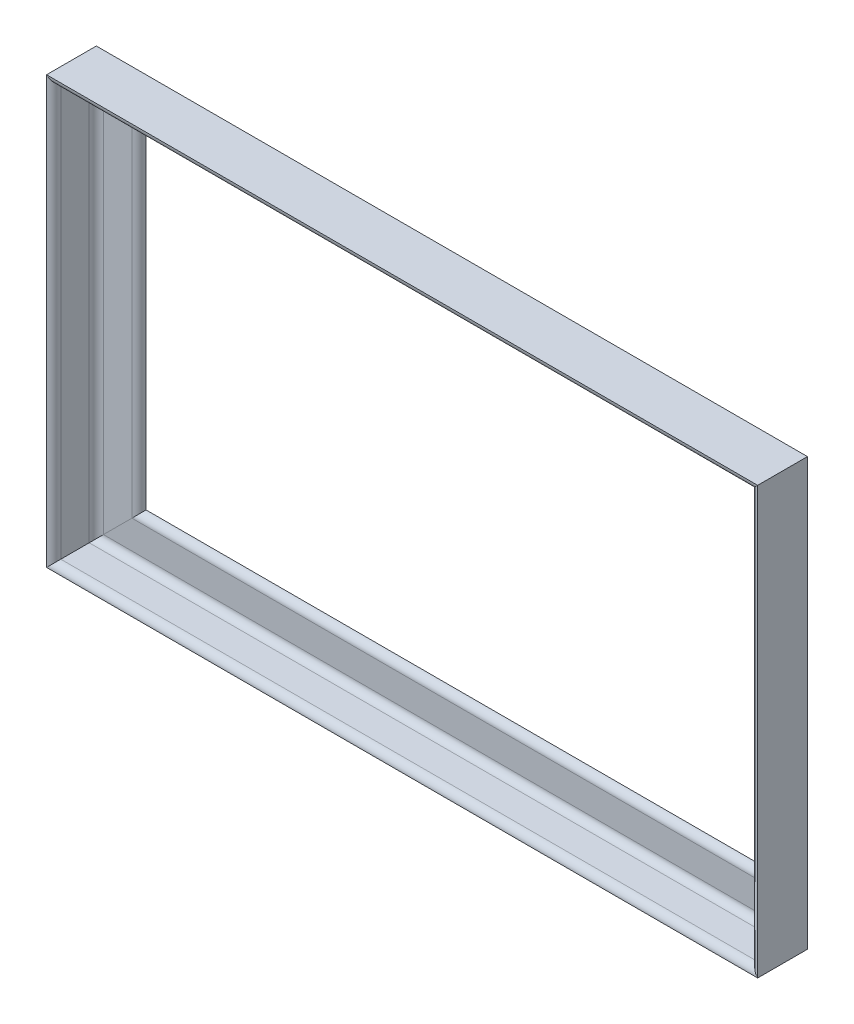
ISO-10303-21;
HEADER;
FILE_DESCRIPTION(('STEP AP214'),'2;1');
FILE_NAME('part.step','',(''),(''),'','','');
FILE_SCHEMA(('AUTOMOTIVE_DESIGN { 1 0 10303 214 1 1 1 1 }'));
ENDSEC;
DATA;
#1=APPLICATION_CONTEXT('core data for automotive mechanical design processes');
#2=APPLICATION_PROTOCOL_DEFINITION('international standard','automotive_design',2000,#1);
#3=PRODUCT_CONTEXT('',#1,'mechanical');
#4=PRODUCT('Part','Part','',(#3));
#5=PRODUCT_RELATED_PRODUCT_CATEGORY('part','',(#4));
#6=PRODUCT_DEFINITION_FORMATION('','',#4);
#7=PRODUCT_DEFINITION_CONTEXT('part definition',#1,'design');
#8=PRODUCT_DEFINITION('design','',#6,#7);
#9=PRODUCT_DEFINITION_SHAPE('','',#8);
#10=(LENGTH_UNIT() NAMED_UNIT(*) SI_UNIT(.MILLI.,.METRE.));
#11=(NAMED_UNIT(*) PLANE_ANGLE_UNIT() SI_UNIT($,.RADIAN.));
#12=(NAMED_UNIT(*) SI_UNIT($,.STERADIAN.) SOLID_ANGLE_UNIT());
#13=UNCERTAINTY_MEASURE_WITH_UNIT(LENGTH_MEASURE(1.E-05),#10,'distance_accuracy_value','');
#14=(GEOMETRIC_REPRESENTATION_CONTEXT(3) GLOBAL_UNCERTAINTY_ASSIGNED_CONTEXT((#13)) GLOBAL_UNIT_ASSIGNED_CONTEXT((#10,
#11,#12)) REPRESENTATION_CONTEXT('',''));
#15=CARTESIAN_POINT('',(0.,0.,0.));
#16=DIRECTION('',(0.,0.,1.));
#17=DIRECTION('',(1.,0.,0.));
#18=AXIS2_PLACEMENT_3D('',#15,#16,#17);
#19=CARTESIAN_POINT('',(250.,-150.,0.));
#20=DIRECTION('',(0.707106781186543,0.707106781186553,0.));
#21=DIRECTION('',(-0.707106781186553,0.707106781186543,0.));
#22=AXIS2_PLACEMENT_3D('',#19,#20,#21);
#23=PLANE('',#22);
#24=CARTESIAN_POINT('',(220.,-120.,0.));
#25=DIRECTION('',(0.707106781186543,0.707106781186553,0.));
#26=DIRECTION('',(0.707106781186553,-0.707106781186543,0.));
#27=AXIS2_PLACEMENT_3D('',#24,#25,#26);
#28=ELLIPSE('',#27,7.07106781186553,5.);
#29=CARTESIAN_POINT('',(220.,-120.,5.));
#30=VERTEX_POINT('',#29);
#31=CARTESIAN_POINT('',(215.,-115.,0.));
#32=VERTEX_POINT('',#31);
#33=EDGE_CURVE('E81',#30,#32,#28,.F.);
#34=ORIENTED_EDGE('',*,*,#33,.F.);
#35=DIRECTION('',(-0.707106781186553,0.707106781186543,0.));
#36=VECTOR('',#35,1.);
#37=CARTESIAN_POINT('',(-5.00000000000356,105.,5.00000000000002));
#38=LINE('',#37,#36);
#39=CARTESIAN_POINT('',(240.,-140.,5.));
#40=VERTEX_POINT('',#39);
#41=EDGE_CURVE('E167',#40,#30,#38,.T.);
#42=ORIENTED_EDGE('',*,*,#41,.F.);
#43=CARTESIAN_POINT('',(240.,-140.,10.));
#44=DIRECTION('',(0.707106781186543,0.707106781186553,0.));
#45=DIRECTION('',(0.707106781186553,-0.707106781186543,0.));
#46=AXIS2_PLACEMENT_3D('',#43,#44,#45);
#47=ELLIPSE('',#46,7.07106781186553,5.);
#48=CARTESIAN_POINT('',(245.,-145.,10.));
#49=VERTEX_POINT('',#48);
#50=EDGE_CURVE('E163',#49,#40,#47,.T.);
#51=ORIENTED_EDGE('',*,*,#50,.F.);
#52=DIRECTION('',(0.,0.,-1.));
#53=VECTOR('',#52,1.);
#54=CARTESIAN_POINT('',(245.,-145.,30.));
#55=LINE('',#54,#53);
#56=CARTESIAN_POINT('',(245.,-145.,30.));
#57=VERTEX_POINT('',#56);
#58=EDGE_CURVE('E159',#57,#49,#55,.T.);
#59=ORIENTED_EDGE('',*,*,#58,.F.);
#60=CARTESIAN_POINT('',(250.,-150.,30.));
#61=DIRECTION('',(0.707106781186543,0.707106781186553,0.));
#62=DIRECTION('',(0.707106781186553,-0.707106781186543,0.));
#63=AXIS2_PLACEMENT_3D('',#60,#61,#62);
#64=ELLIPSE('',#63,7.07106781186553,5.);
#65=CARTESIAN_POINT('',(250.,-150.,35.));
#66=VERTEX_POINT('',#65);
#67=EDGE_CURVE('E124',#66,#57,#64,.F.);
#68=ORIENTED_EDGE('',*,*,#67,.F.);
#69=DIRECTION('',(0.,0.,1.));
#70=VECTOR('',#69,1.);
#71=CARTESIAN_POINT('',(250.,-150.,0.));
#72=LINE('',#71,#70);
#73=CARTESIAN_POINT('',(250.,-150.,0.));
#74=VERTEX_POINT('',#73);
#75=EDGE_CURVE('E128',#74,#66,#72,.T.);
#76=ORIENTED_EDGE('',*,*,#75,.F.);
#77=DIRECTION('',(0.707106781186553,-0.707106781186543,0.));
#78=VECTOR('',#77,1.);
#79=CARTESIAN_POINT('',(-17.5000000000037,117.5,0.));
#80=LINE('',#79,#78);
#81=EDGE_CURVE('E131',#32,#74,#80,.T.);
#82=ORIENTED_EDGE('',*,*,#81,.F.);
#83=EDGE_LOOP('',(#34,#42,#51,#59,#68,#76,#82));
#84=FACE_BOUND('',#83,.T.);
#85=ADVANCED_FACE('F72',(#84),#23,.T.);
#86=CARTESIAN_POINT('',(-250.,-150.,0.));
#87=DIRECTION('',(-0.707106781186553,0.707106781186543,0.));
#88=DIRECTION('',(-0.707106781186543,-0.707106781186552,0.));
#89=AXIS2_PLACEMENT_3D('',#86,#87,#88);
#90=PLANE('',#89);
#91=DIRECTION('',(0.707106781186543,0.707106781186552,0.));
#92=VECTOR('',#91,1.);
#93=CARTESIAN_POINT('',(-232.5,-132.5,0.));
#94=LINE('',#93,#92);
#95=CARTESIAN_POINT('',(-250.,-150.,0.));
#96=VERTEX_POINT('',#95);
#97=CARTESIAN_POINT('',(-215.,-115.,0.));
#98=VERTEX_POINT('',#97);
#99=EDGE_CURVE('E137',#96,#98,#94,.T.);
#100=ORIENTED_EDGE('',*,*,#99,.F.);
#101=DIRECTION('',(0.,0.,-1.));
#102=VECTOR('',#101,1.);
#103=CARTESIAN_POINT('',(-250.,-150.,0.));
#104=LINE('',#103,#102);
#105=CARTESIAN_POINT('',(-250.,-150.,35.));
#106=VERTEX_POINT('',#105);
#107=EDGE_CURVE('E155',#106,#96,#104,.T.);
#108=ORIENTED_EDGE('',*,*,#107,.F.);
#109=CARTESIAN_POINT('',(-250.,-150.,30.));
#110=DIRECTION('',(-0.707106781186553,0.707106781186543,0.));
#111=DIRECTION('',(0.707106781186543,0.707106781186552,0.));
#112=AXIS2_PLACEMENT_3D('',#109,#110,#111);
#113=ELLIPSE('',#112,7.07106781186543,5.);
#114=CARTESIAN_POINT('',(-245.,-145.,30.));
#115=VERTEX_POINT('',#114);
#116=EDGE_CURVE('E160',#115,#106,#113,.F.);
#117=ORIENTED_EDGE('',*,*,#116,.F.);
#118=DIRECTION('',(0.,0.,1.));
#119=VECTOR('',#118,1.);
#120=CARTESIAN_POINT('',(-245.,-145.,30.));
#121=LINE('',#120,#119);
#122=CARTESIAN_POINT('',(-245.,-145.,10.));
#123=VERTEX_POINT('',#122);
#124=EDGE_CURVE('E164',#123,#115,#121,.T.);
#125=ORIENTED_EDGE('',*,*,#124,.F.);
#126=CARTESIAN_POINT('',(-240.,-140.,10.));
#127=DIRECTION('',(-0.707106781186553,0.707106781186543,0.));
#128=DIRECTION('',(0.707106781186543,0.707106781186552,0.));
#129=AXIS2_PLACEMENT_3D('',#126,#127,#128);
#130=ELLIPSE('',#129,7.07106781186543,5.);
#131=CARTESIAN_POINT('',(-240.,-140.,5.));
#132=VERTEX_POINT('',#131);
#133=EDGE_CURVE('E168',#132,#123,#130,.T.);
#134=ORIENTED_EDGE('',*,*,#133,.F.);
#135=DIRECTION('',(-0.707106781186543,-0.707106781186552,0.));
#136=VECTOR('',#135,1.);
#137=CARTESIAN_POINT('',(-245.,-145.,5.));
#138=LINE('',#137,#136);
#139=CARTESIAN_POINT('',(-220.,-120.,5.));
#140=VERTEX_POINT('',#139);
#141=EDGE_CURVE('E173',#140,#132,#138,.T.);
#142=ORIENTED_EDGE('',*,*,#141,.F.);
#143=CARTESIAN_POINT('',(-220.,-120.,0.));
#144=DIRECTION('',(-0.707106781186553,0.707106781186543,0.));
#145=DIRECTION('',(0.707106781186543,0.707106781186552,0.));
#146=AXIS2_PLACEMENT_3D('',#143,#144,#145);
#147=ELLIPSE('',#146,7.07106781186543,5.);
#148=EDGE_CURVE('E14',#98,#140,#147,.F.);
#149=ORIENTED_EDGE('',*,*,#148,.F.);
#150=EDGE_LOOP('',(#100,#108,#117,#125,#134,#142,#149));
#151=FACE_BOUND('',#150,.T.);
#152=ADVANCED_FACE('F195',(#151),#90,.T.);
#153=CARTESIAN_POINT('',(-250.,-115.,0.));
#154=DIRECTION('',(0.,0.,-1.));
#155=DIRECTION('',(-1.,0.,0.));
#156=AXIS2_PLACEMENT_3D('',#153,#154,#155);
#157=PLANE('',#156);
#158=DIRECTION('',(1.,0.,0.));
#159=VECTOR('',#158,1.);
#160=CARTESIAN_POINT('',(-250.,-115.,0.));
#161=LINE('',#160,#159);
#162=EDGE_CURVE('E138',#98,#32,#161,.T.);
#163=ORIENTED_EDGE('',*,*,#162,.T.);
#164=ORIENTED_EDGE('',*,*,#81,.T.);
#165=DIRECTION('',(1.,0.,0.));
#166=VECTOR('',#165,1.);
#167=CARTESIAN_POINT('',(-250.,-150.,0.));
#168=LINE('',#167,#166);
#169=EDGE_CURVE('E151',#96,#74,#168,.T.);
#170=ORIENTED_EDGE('',*,*,#169,.F.);
#171=ORIENTED_EDGE('',*,*,#99,.T.);
#172=EDGE_LOOP('',(#163,#164,#170,#171));
#173=FACE_BOUND('',#172,.T.);
#174=ADVANCED_FACE('F146',(#173),#157,.T.);
#175=CARTESIAN_POINT('',(-250.,-150.,0.));
#176=DIRECTION('',(0.,-1.,0.));
#177=DIRECTION('',(0.,0.,-1.));
#178=AXIS2_PLACEMENT_3D('',#175,#176,#177);
#179=PLANE('',#178);
#180=ORIENTED_EDGE('',*,*,#169,.T.);
#181=ORIENTED_EDGE('',*,*,#75,.T.);
#182=DIRECTION('',(1.,0.,0.));
#183=VECTOR('',#182,1.);
#184=CARTESIAN_POINT('',(-250.,-150.,35.));
#185=LINE('',#184,#183);
#186=EDGE_CURVE('E153',#106,#66,#185,.T.);
#187=ORIENTED_EDGE('',*,*,#186,.F.);
#188=ORIENTED_EDGE('',*,*,#107,.T.);
#189=EDGE_LOOP('',(#180,#181,#187,#188));
#190=FACE_BOUND('',#189,.T.);
#191=ADVANCED_FACE('F194',(#190),#179,.T.);
#192=CARTESIAN_POINT('',(-250.,-150.,30.));
#193=DIRECTION('',(1.,0.,0.));
#194=DIRECTION('',(0.,0.,-1.));
#195=AXIS2_PLACEMENT_3D('',#192,#193,#194);
#196=CYLINDRICAL_SURFACE('',#195,5.);
#197=ORIENTED_EDGE('',*,*,#186,.T.);
#198=ORIENTED_EDGE('',*,*,#67,.T.);
#199=DIRECTION('',(1.,0.,0.));
#200=VECTOR('',#199,1.);
#201=CARTESIAN_POINT('',(-250.,-145.,30.));
#202=LINE('',#201,#200);
#203=EDGE_CURVE('E156',#115,#57,#202,.T.);
#204=ORIENTED_EDGE('',*,*,#203,.F.);
#205=ORIENTED_EDGE('',*,*,#116,.T.);
#206=EDGE_LOOP('',(#197,#198,#204,#205));
#207=FACE_BOUND('',#206,.T.);
#208=ADVANCED_FACE('F191',(#207),#196,.T.);
#209=CARTESIAN_POINT('',(-250.,-145.,30.));
#210=DIRECTION('',(0.,1.,0.));
#211=DIRECTION('',(0.,0.,1.));
#212=AXIS2_PLACEMENT_3D('',#209,#210,#211);
#213=PLANE('',#212);
#214=ORIENTED_EDGE('',*,*,#203,.T.);
#215=ORIENTED_EDGE('',*,*,#58,.T.);
#216=DIRECTION('',(1.,0.,0.));
#217=VECTOR('',#216,1.);
#218=CARTESIAN_POINT('',(-250.,-145.,10.));
#219=LINE('',#218,#217);
#220=EDGE_CURVE('E161',#123,#49,#219,.T.);
#221=ORIENTED_EDGE('',*,*,#220,.F.);
#222=ORIENTED_EDGE('',*,*,#124,.T.);
#223=EDGE_LOOP('',(#214,#215,#221,#222));
#224=FACE_BOUND('',#223,.T.);
#225=ADVANCED_FACE('F198',(#224),#213,.T.);
#226=CARTESIAN_POINT('',(-250.,-140.,10.));
#227=DIRECTION('',(1.,0.,0.));
#228=DIRECTION('',(0.,0.,-1.));
#229=AXIS2_PLACEMENT_3D('',#226,#227,#228);
#230=CYLINDRICAL_SURFACE('',#229,5.);
#231=ORIENTED_EDGE('',*,*,#220,.T.);
#232=ORIENTED_EDGE('',*,*,#50,.T.);
#233=DIRECTION('',(1.,0.,0.));
#234=VECTOR('',#233,1.);
#235=CARTESIAN_POINT('',(-250.,-140.,4.99999999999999));
#236=LINE('',#235,#234);
#237=EDGE_CURVE('E165',#132,#40,#236,.T.);
#238=ORIENTED_EDGE('',*,*,#237,.F.);
#239=ORIENTED_EDGE('',*,*,#133,.T.);
#240=EDGE_LOOP('',(#231,#232,#238,#239));
#241=FACE_BOUND('',#240,.T.);
#242=ADVANCED_FACE('F199',(#241),#230,.F.);
#243=CARTESIAN_POINT('',(-250.,-140.,5.));
#244=DIRECTION('',(0.,0.,1.));
#245=DIRECTION('',(0.,-1.,0.));
#246=AXIS2_PLACEMENT_3D('',#243,#244,#245);
#247=PLANE('',#246);
#248=ORIENTED_EDGE('',*,*,#237,.T.);
#249=ORIENTED_EDGE('',*,*,#41,.T.);
#250=DIRECTION('',(1.,0.,0.));
#251=VECTOR('',#250,1.);
#252=CARTESIAN_POINT('',(-250.,-120.,5.));
#253=LINE('',#252,#251);
#254=EDGE_CURVE('E75',#140,#30,#253,.T.);
#255=ORIENTED_EDGE('',*,*,#254,.F.);
#256=ORIENTED_EDGE('',*,*,#141,.T.);
#257=EDGE_LOOP('',(#248,#249,#255,#256));
#258=FACE_BOUND('',#257,.T.);
#259=ADVANCED_FACE('F200',(#258),#247,.T.);
#260=CARTESIAN_POINT('',(-250.,-120.,0.));
#261=DIRECTION('',(1.,0.,0.));
#262=DIRECTION('',(0.,0.,-1.));
#263=AXIS2_PLACEMENT_3D('',#260,#261,#262);
#264=CYLINDRICAL_SURFACE('',#263,5.);
#265=ORIENTED_EDGE('',*,*,#254,.T.);
#266=ORIENTED_EDGE('',*,*,#33,.T.);
#267=ORIENTED_EDGE('',*,*,#162,.F.);
#268=ORIENTED_EDGE('',*,*,#148,.T.);
#269=EDGE_LOOP('',(#265,#266,#267,#268));
#270=FACE_BOUND('',#269,.T.);
#271=ADVANCED_FACE('F142',(#270),#264,.T.);
#272=CLOSED_SHELL('',(#85,#152,#174,#191,#208,#225,#242,#259,#271));
#273=MANIFOLD_SOLID_BREP('B2',#272);
#274=CARTESIAN_POINT('',(250.,-150.,0.));
#275=DIRECTION('',(-0.707106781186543,-0.707106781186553,0.));
#276=DIRECTION('',(0.707106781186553,-0.707106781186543,0.));
#277=AXIS2_PLACEMENT_3D('',#274,#275,#276);
#278=PLANE('',#277);
#279=CARTESIAN_POINT('',(220.,-120.,0.));
#280=DIRECTION('',(-0.707106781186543,-0.707106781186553,0.));
#281=DIRECTION('',(-0.707106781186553,0.707106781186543,0.));
#282=AXIS2_PLACEMENT_3D('',#279,#280,#281);
#283=ELLIPSE('',#282,7.07106781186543,5.);
#284=CARTESIAN_POINT('',(215.,-115.,0.));
#285=VERTEX_POINT('',#284);
#286=CARTESIAN_POINT('',(220.,-120.,5.));
#287=VERTEX_POINT('',#286);
#288=EDGE_CURVE('E376',#285,#287,#283,.F.);
#289=ORIENTED_EDGE('',*,*,#288,.F.);
#290=DIRECTION('',(-0.707106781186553,0.707106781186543,0.));
#291=VECTOR('',#290,1.);
#292=CARTESIAN_POINT('',(232.5,-132.5,0.));
#293=LINE('',#292,#291);
#294=CARTESIAN_POINT('',(250.,-150.,0.));
#295=VERTEX_POINT('',#294);
#296=EDGE_CURVE('E375',#295,#285,#293,.T.);
#297=ORIENTED_EDGE('',*,*,#296,.F.);
#298=DIRECTION('',(0.,0.,-1.));
#299=VECTOR('',#298,1.);
#300=CARTESIAN_POINT('',(250.,-150.,0.));
#301=LINE('',#300,#299);
#302=CARTESIAN_POINT('',(250.,-150.,35.));
#303=VERTEX_POINT('',#302);
#304=EDGE_CURVE('E371',#303,#295,#301,.T.);
#305=ORIENTED_EDGE('',*,*,#304,.F.);
#306=CARTESIAN_POINT('',(250.,-150.,30.));
#307=DIRECTION('',(-0.707106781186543,-0.707106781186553,0.));
#308=DIRECTION('',(-0.707106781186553,0.707106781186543,0.));
#309=AXIS2_PLACEMENT_3D('',#306,#307,#308);
#310=ELLIPSE('',#309,7.07106781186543,5.);
#311=CARTESIAN_POINT('',(245.,-145.,30.));
#312=VERTEX_POINT('',#311);
#313=EDGE_CURVE('E408',#312,#303,#310,.F.);
#314=ORIENTED_EDGE('',*,*,#313,.F.);
#315=DIRECTION('',(0.,0.,1.));
#316=VECTOR('',#315,1.);
#317=CARTESIAN_POINT('',(245.,-145.,30.));
#318=LINE('',#317,#316);
#319=CARTESIAN_POINT('',(245.,-145.,10.));
#320=VERTEX_POINT('',#319);
#321=EDGE_CURVE('E403',#320,#312,#318,.T.);
#322=ORIENTED_EDGE('',*,*,#321,.F.);
#323=CARTESIAN_POINT('',(240.,-140.,10.));
#324=DIRECTION('',(-0.707106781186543,-0.707106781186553,0.));
#325=DIRECTION('',(-0.707106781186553,0.707106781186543,0.));
#326=AXIS2_PLACEMENT_3D('',#323,#324,#325);
#327=ELLIPSE('',#326,7.07106781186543,5.);
#328=CARTESIAN_POINT('',(240.,-140.,5.));
#329=VERTEX_POINT('',#328);
#330=EDGE_CURVE('E398',#329,#320,#327,.T.);
#331=ORIENTED_EDGE('',*,*,#330,.F.);
#332=DIRECTION('',(0.707106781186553,-0.707106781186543,0.));
#333=VECTOR('',#332,1.);
#334=CARTESIAN_POINT('',(245.,-145.,5.));
#335=LINE('',#334,#333);
#336=EDGE_CURVE('E379',#287,#329,#335,.T.);
#337=ORIENTED_EDGE('',*,*,#336,.F.);
#338=EDGE_LOOP('',(#289,#297,#305,#314,#322,#331,#337));
#339=FACE_BOUND('',#338,.T.);
#340=ADVANCED_FACE('F318',(#339),#278,.T.);
#341=CARTESIAN_POINT('',(250.,150.,0.));
#342=DIRECTION('',(-0.707106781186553,0.707106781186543,0.));
#343=DIRECTION('',(-0.707106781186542,-0.707106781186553,0.));
#344=AXIS2_PLACEMENT_3D('',#341,#342,#343);
#345=PLANE('',#344);
#346=DIRECTION('',(0.707106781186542,0.707106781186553,0.));
#347=VECTOR('',#346,1.);
#348=CARTESIAN_POINT('',(82.5000000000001,-17.5000000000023,0.));
#349=LINE('',#348,#347);
#350=CARTESIAN_POINT('',(215.,115.,0.));
#351=VERTEX_POINT('',#350);
#352=CARTESIAN_POINT('',(250.,150.,0.));
#353=VERTEX_POINT('',#352);
#354=EDGE_CURVE('E387',#351,#353,#349,.T.);
#355=ORIENTED_EDGE('',*,*,#354,.F.);
#356=CARTESIAN_POINT('',(220.,120.,0.));
#357=DIRECTION('',(-0.707106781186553,0.707106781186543,0.));
#358=DIRECTION('',(0.707106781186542,0.707106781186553,0.));
#359=AXIS2_PLACEMENT_3D('',#356,#357,#358);
#360=ELLIPSE('',#359,7.07106781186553,5.);
#361=CARTESIAN_POINT('',(220.,120.,5.));
#362=VERTEX_POINT('',#361);
#363=EDGE_CURVE('E70',#362,#351,#360,.F.);
#364=ORIENTED_EDGE('',*,*,#363,.F.);
#365=DIRECTION('',(-0.707106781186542,-0.707106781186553,0.));
#366=VECTOR('',#365,1.);
#367=CARTESIAN_POINT('',(94.9999999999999,-5.00000000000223,5.00000000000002));
#368=LINE('',#367,#366);
#369=CARTESIAN_POINT('',(240.,140.,5.));
#370=VERTEX_POINT('',#369);
#371=EDGE_CURVE('E380',#370,#362,#368,.T.);
#372=ORIENTED_EDGE('',*,*,#371,.F.);
#373=CARTESIAN_POINT('',(240.,140.,10.));
#374=DIRECTION('',(-0.707106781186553,0.707106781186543,0.));
#375=DIRECTION('',(0.707106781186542,0.707106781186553,0.));
#376=AXIS2_PLACEMENT_3D('',#373,#374,#375);
#377=ELLIPSE('',#376,7.07106781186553,5.);
#378=CARTESIAN_POINT('',(245.,145.,10.));
#379=VERTEX_POINT('',#378);
#380=EDGE_CURVE('E397',#379,#370,#377,.T.);
#381=ORIENTED_EDGE('',*,*,#380,.F.);
#382=DIRECTION('',(0.,0.,-1.));
#383=VECTOR('',#382,1.);
#384=CARTESIAN_POINT('',(245.,145.,30.));
#385=LINE('',#384,#383);
#386=CARTESIAN_POINT('',(245.,145.,30.));
#387=VERTEX_POINT('',#386);
#388=EDGE_CURVE('E402',#387,#379,#385,.T.);
#389=ORIENTED_EDGE('',*,*,#388,.F.);
#390=CARTESIAN_POINT('',(250.,150.,30.));
#391=DIRECTION('',(-0.707106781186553,0.707106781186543,0.));
#392=DIRECTION('',(0.707106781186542,0.707106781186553,0.));
#393=AXIS2_PLACEMENT_3D('',#390,#391,#392);
#394=ELLIPSE('',#393,7.07106781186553,5.);
#395=CARTESIAN_POINT('',(250.,150.,35.));
#396=VERTEX_POINT('',#395);
#397=EDGE_CURVE('E407',#396,#387,#394,.F.);
#398=ORIENTED_EDGE('',*,*,#397,.F.);
#399=DIRECTION('',(0.,0.,1.));
#400=VECTOR('',#399,1.);
#401=CARTESIAN_POINT('',(250.,150.,0.));
#402=LINE('',#401,#400);
#403=EDGE_CURVE('E412',#353,#396,#402,.T.);
#404=ORIENTED_EDGE('',*,*,#403,.F.);
#405=EDGE_LOOP('',(#355,#364,#372,#381,#389,#398,#404));
#406=FACE_BOUND('',#405,.T.);
#407=ADVANCED_FACE('F432',(#406),#345,.T.);
#408=CARTESIAN_POINT('',(215.,-150.,0.));
#409=DIRECTION('',(0.,0.,-1.));
#410=DIRECTION('',(-1.,0.,0.));
#411=AXIS2_PLACEMENT_3D('',#408,#409,#410);
#412=PLANE('',#411);
#413=DIRECTION('',(0.,1.,0.));
#414=VECTOR('',#413,1.);
#415=CARTESIAN_POINT('',(250.,-150.,0.));
#416=LINE('',#415,#414);
#417=EDGE_CURVE('E391',#295,#353,#416,.T.);
#418=ORIENTED_EDGE('',*,*,#417,.F.);
#419=ORIENTED_EDGE('',*,*,#296,.T.);
#420=DIRECTION('',(0.,1.,0.));
#421=VECTOR('',#420,1.);
#422=CARTESIAN_POINT('',(215.,-150.,0.));
#423=LINE('',#422,#421);
#424=EDGE_CURVE('E382',#285,#351,#423,.T.);
#425=ORIENTED_EDGE('',*,*,#424,.T.);
#426=ORIENTED_EDGE('',*,*,#354,.T.);
#427=EDGE_LOOP('',(#418,#419,#425,#426));
#428=FACE_BOUND('',#427,.T.);
#429=ADVANCED_FACE('F390',(#428),#412,.T.);
#430=CARTESIAN_POINT('',(250.,-150.,0.));
#431=DIRECTION('',(1.,0.,0.));
#432=DIRECTION('',(0.,0.,-1.));
#433=AXIS2_PLACEMENT_3D('',#430,#431,#432);
#434=PLANE('',#433);
#435=DIRECTION('',(0.,1.,0.));
#436=VECTOR('',#435,1.);
#437=CARTESIAN_POINT('',(250.,-150.,35.));
#438=LINE('',#437,#436);
#439=EDGE_CURVE('E411',#303,#396,#438,.T.);
#440=ORIENTED_EDGE('',*,*,#439,.F.);
#441=ORIENTED_EDGE('',*,*,#304,.T.);
#442=ORIENTED_EDGE('',*,*,#417,.T.);
#443=ORIENTED_EDGE('',*,*,#403,.T.);
#444=EDGE_LOOP('',(#440,#441,#442,#443));
#445=FACE_BOUND('',#444,.T.);
#446=ADVANCED_FACE('F436',(#445),#434,.T.);
#447=CARTESIAN_POINT('',(250.,-150.,30.));
#448=DIRECTION('',(0.,1.,0.));
#449=DIRECTION('',(0.,0.,1.));
#450=AXIS2_PLACEMENT_3D('',#447,#448,#449);
#451=CYLINDRICAL_SURFACE('',#450,5.);
#452=DIRECTION('',(0.,1.,0.));
#453=VECTOR('',#452,1.);
#454=CARTESIAN_POINT('',(245.,-150.,30.));
#455=LINE('',#454,#453);
#456=EDGE_CURVE('E406',#312,#387,#455,.T.);
#457=ORIENTED_EDGE('',*,*,#456,.F.);
#458=ORIENTED_EDGE('',*,*,#313,.T.);
#459=ORIENTED_EDGE('',*,*,#439,.T.);
#460=ORIENTED_EDGE('',*,*,#397,.T.);
#461=EDGE_LOOP('',(#457,#458,#459,#460));
#462=FACE_BOUND('',#461,.T.);
#463=ADVANCED_FACE('F439',(#462),#451,.T.);
#464=CARTESIAN_POINT('',(245.,-150.,30.));
#465=DIRECTION('',(-1.,0.,0.));
#466=DIRECTION('',(0.,0.,1.));
#467=AXIS2_PLACEMENT_3D('',#464,#465,#466);
#468=PLANE('',#467);
#469=DIRECTION('',(0.,1.,0.));
#470=VECTOR('',#469,1.);
#471=CARTESIAN_POINT('',(245.,-150.,10.));
#472=LINE('',#471,#470);
#473=EDGE_CURVE('E401',#320,#379,#472,.T.);
#474=ORIENTED_EDGE('',*,*,#473,.F.);
#475=ORIENTED_EDGE('',*,*,#321,.T.);
#476=ORIENTED_EDGE('',*,*,#456,.T.);
#477=ORIENTED_EDGE('',*,*,#388,.T.);
#478=EDGE_LOOP('',(#474,#475,#476,#477));
#479=FACE_BOUND('',#478,.T.);
#480=ADVANCED_FACE('F442',(#479),#468,.T.);
#481=CARTESIAN_POINT('',(240.,-150.,10.));
#482=DIRECTION('',(0.,1.,0.));
#483=DIRECTION('',(0.,0.,1.));
#484=AXIS2_PLACEMENT_3D('',#481,#482,#483);
#485=CYLINDRICAL_SURFACE('',#484,5.);
#486=DIRECTION('',(0.,1.,0.));
#487=VECTOR('',#486,1.);
#488=CARTESIAN_POINT('',(240.,-150.,5.));
#489=LINE('',#488,#487);
#490=EDGE_CURVE('E396',#329,#370,#489,.T.);
#491=ORIENTED_EDGE('',*,*,#490,.F.);
#492=ORIENTED_EDGE('',*,*,#330,.T.);
#493=ORIENTED_EDGE('',*,*,#473,.T.);
#494=ORIENTED_EDGE('',*,*,#380,.T.);
#495=EDGE_LOOP('',(#491,#492,#493,#494));
#496=FACE_BOUND('',#495,.T.);
#497=ADVANCED_FACE('F445',(#496),#485,.F.);
#498=CARTESIAN_POINT('',(240.,-150.,5.));
#499=DIRECTION('',(0.,0.,1.));
#500=DIRECTION('',(1.,0.,0.));
#501=AXIS2_PLACEMENT_3D('',#498,#499,#500);
#502=PLANE('',#501);
#503=DIRECTION('',(0.,1.,0.));
#504=VECTOR('',#503,1.);
#505=CARTESIAN_POINT('',(220.,-150.,5.));
#506=LINE('',#505,#504);
#507=EDGE_CURVE('E321',#287,#362,#506,.T.);
#508=ORIENTED_EDGE('',*,*,#507,.F.);
#509=ORIENTED_EDGE('',*,*,#336,.T.);
#510=ORIENTED_EDGE('',*,*,#490,.T.);
#511=ORIENTED_EDGE('',*,*,#371,.T.);
#512=EDGE_LOOP('',(#508,#509,#510,#511));
#513=FACE_BOUND('',#512,.T.);
#514=ADVANCED_FACE('F446',(#513),#502,.T.);
#515=CARTESIAN_POINT('',(220.,-150.,0.));
#516=DIRECTION('',(0.,1.,0.));
#517=DIRECTION('',(0.,0.,1.));
#518=AXIS2_PLACEMENT_3D('',#515,#516,#517);
#519=CYLINDRICAL_SURFACE('',#518,5.);
#520=ORIENTED_EDGE('',*,*,#424,.F.);
#521=ORIENTED_EDGE('',*,*,#288,.T.);
#522=ORIENTED_EDGE('',*,*,#507,.T.);
#523=ORIENTED_EDGE('',*,*,#363,.T.);
#524=EDGE_LOOP('',(#520,#521,#522,#523));
#525=FACE_BOUND('',#524,.T.);
#526=ADVANCED_FACE('F383',(#525),#519,.T.);
#527=CLOSED_SHELL('',(#340,#407,#429,#446,#463,#480,#497,#514,#526));
#528=MANIFOLD_SOLID_BREP('B8',#527);
#529=CARTESIAN_POINT('',(-250.,-150.,0.));
#530=DIRECTION('',(0.707106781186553,-0.707106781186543,0.));
#531=DIRECTION('',(0.707106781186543,0.707106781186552,0.));
#532=AXIS2_PLACEMENT_3D('',#529,#530,#531);
#533=PLANE('',#532);
#534=CARTESIAN_POINT('',(-220.,-120.,0.));
#535=DIRECTION('',(0.707106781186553,-0.707106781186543,0.));
#536=DIRECTION('',(-0.707106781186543,-0.707106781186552,0.));
#537=AXIS2_PLACEMENT_3D('',#534,#535,#536);
#538=ELLIPSE('',#537,7.07106781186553,5.);
#539=CARTESIAN_POINT('',(-220.,-120.,5.));
#540=VERTEX_POINT('',#539);
#541=CARTESIAN_POINT('',(-215.,-114.999999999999,0.));
#542=VERTEX_POINT('',#541);
#543=EDGE_CURVE('E572',#540,#542,#538,.F.);
#544=ORIENTED_EDGE('',*,*,#543,.F.);
#545=DIRECTION('',(0.707106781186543,0.707106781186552,0.));
#546=VECTOR('',#545,1.);
#547=CARTESIAN_POINT('',(-95.,5.00000000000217,5.00000000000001));
#548=LINE('',#547,#546);
#549=CARTESIAN_POINT('',(-240.,-140.,4.99999999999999));
#550=VERTEX_POINT('',#549);
#551=EDGE_CURVE('E658',#550,#540,#548,.T.);
#552=ORIENTED_EDGE('',*,*,#551,.F.);
#553=CARTESIAN_POINT('',(-240.,-140.,10.));
#554=DIRECTION('',(0.707106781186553,-0.707106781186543,0.));
#555=DIRECTION('',(-0.707106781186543,-0.707106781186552,0.));
#556=AXIS2_PLACEMENT_3D('',#553,#554,#555);
#557=ELLIPSE('',#556,7.07106781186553,5.);
#558=CARTESIAN_POINT('',(-245.,-145.,10.));
#559=VERTEX_POINT('',#558);
#560=EDGE_CURVE('E654',#559,#550,#557,.T.);
#561=ORIENTED_EDGE('',*,*,#560,.F.);
#562=DIRECTION('',(0.,0.,-1.));
#563=VECTOR('',#562,1.);
#564=CARTESIAN_POINT('',(-245.,-145.,30.));
#565=LINE('',#564,#563);
#566=CARTESIAN_POINT('',(-245.,-145.,30.));
#567=VERTEX_POINT('',#566);
#568=EDGE_CURVE('E650',#567,#559,#565,.T.);
#569=ORIENTED_EDGE('',*,*,#568,.F.);
#570=CARTESIAN_POINT('',(-250.,-150.,30.));
#571=DIRECTION('',(0.707106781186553,-0.707106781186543,0.));
#572=DIRECTION('',(-0.707106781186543,-0.707106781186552,0.));
#573=AXIS2_PLACEMENT_3D('',#570,#571,#572);
#574=ELLIPSE('',#573,7.07106781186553,5.);
#575=CARTESIAN_POINT('',(-250.,-150.,35.));
#576=VERTEX_POINT('',#575);
#577=EDGE_CURVE('E615',#576,#567,#574,.F.);
#578=ORIENTED_EDGE('',*,*,#577,.F.);
#579=DIRECTION('',(0.,0.,1.));
#580=VECTOR('',#579,1.);
#581=CARTESIAN_POINT('',(-250.,-150.,0.));
#582=LINE('',#581,#580);
#583=CARTESIAN_POINT('',(-250.,-150.,0.));
#584=VERTEX_POINT('',#583);
#585=EDGE_CURVE('E619',#584,#576,#582,.T.);
#586=ORIENTED_EDGE('',*,*,#585,.F.);
#587=DIRECTION('',(-0.707106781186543,-0.707106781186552,0.));
#588=VECTOR('',#587,1.);
#589=CARTESIAN_POINT('',(-82.5000000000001,17.5000000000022,0.));
#590=LINE('',#589,#588);
#591=EDGE_CURVE('E622',#542,#584,#590,.T.);
#592=ORIENTED_EDGE('',*,*,#591,.F.);
#593=EDGE_LOOP('',(#544,#552,#561,#569,#578,#586,#592));
#594=FACE_BOUND('',#593,.T.);
#595=ADVANCED_FACE('F563',(#594),#533,.T.);
#596=CARTESIAN_POINT('',(-250.,150.,0.));
#597=DIRECTION('',(0.707106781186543,0.707106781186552,0.));
#598=DIRECTION('',(-0.707106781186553,0.707106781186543,0.));
#599=AXIS2_PLACEMENT_3D('',#596,#597,#598);
#600=PLANE('',#599);
#601=DIRECTION('',(0.707106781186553,-0.707106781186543,0.));
#602=VECTOR('',#601,1.);
#603=CARTESIAN_POINT('',(-232.5,132.5,0.));
#604=LINE('',#603,#602);
#605=CARTESIAN_POINT('',(-250.,150.,0.));
#606=VERTEX_POINT('',#605);
#607=CARTESIAN_POINT('',(-215.,115.,0.));
#608=VERTEX_POINT('',#607);
#609=EDGE_CURVE('E628',#606,#608,#604,.T.);
#610=ORIENTED_EDGE('',*,*,#609,.F.);
#611=DIRECTION('',(0.,0.,-1.));
#612=VECTOR('',#611,1.);
#613=CARTESIAN_POINT('',(-250.,150.,0.));
#614=LINE('',#613,#612);
#615=CARTESIAN_POINT('',(-250.,150.,35.));
#616=VERTEX_POINT('',#615);
#617=EDGE_CURVE('E646',#616,#606,#614,.T.);
#618=ORIENTED_EDGE('',*,*,#617,.F.);
#619=CARTESIAN_POINT('',(-250.,150.,30.));
#620=DIRECTION('',(0.707106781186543,0.707106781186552,0.));
#621=DIRECTION('',(0.707106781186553,-0.707106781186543,0.));
#622=AXIS2_PLACEMENT_3D('',#619,#620,#621);
#623=ELLIPSE('',#622,7.07106781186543,5.);
#624=CARTESIAN_POINT('',(-245.,145.,30.));
#625=VERTEX_POINT('',#624);
#626=EDGE_CURVE('E651',#625,#616,#623,.F.);
#627=ORIENTED_EDGE('',*,*,#626,.F.);
#628=DIRECTION('',(0.,0.,1.));
#629=VECTOR('',#628,1.);
#630=CARTESIAN_POINT('',(-245.,145.,30.));
#631=LINE('',#630,#629);
#632=CARTESIAN_POINT('',(-245.,145.,10.));
#633=VERTEX_POINT('',#632);
#634=EDGE_CURVE('E655',#633,#625,#631,.T.);
#635=ORIENTED_EDGE('',*,*,#634,.F.);
#636=CARTESIAN_POINT('',(-240.,140.,10.));
#637=DIRECTION('',(0.707106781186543,0.707106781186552,0.));
#638=DIRECTION('',(0.707106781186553,-0.707106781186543,0.));
#639=AXIS2_PLACEMENT_3D('',#636,#637,#638);
#640=ELLIPSE('',#639,7.07106781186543,5.);
#641=CARTESIAN_POINT('',(-240.,140.,5.));
#642=VERTEX_POINT('',#641);
#643=EDGE_CURVE('E659',#642,#633,#640,.T.);
#644=ORIENTED_EDGE('',*,*,#643,.F.);
#645=DIRECTION('',(-0.707106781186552,0.707106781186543,0.));
#646=VECTOR('',#645,1.);
#647=CARTESIAN_POINT('',(-245.,145.,5.));
#648=LINE('',#647,#646);
#649=CARTESIAN_POINT('',(-220.,120.,5.));
#650=VERTEX_POINT('',#649);
#651=EDGE_CURVE('E664',#650,#642,#648,.T.);
#652=ORIENTED_EDGE('',*,*,#651,.F.);
#653=CARTESIAN_POINT('',(-220.,120.,0.));
#654=DIRECTION('',(0.707106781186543,0.707106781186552,0.));
#655=DIRECTION('',(0.707106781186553,-0.707106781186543,0.));
#656=AXIS2_PLACEMENT_3D('',#653,#654,#655);
#657=ELLIPSE('',#656,7.07106781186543,5.);
#658=EDGE_CURVE('E316',#608,#650,#657,.F.);
#659=ORIENTED_EDGE('',*,*,#658,.F.);
#660=EDGE_LOOP('',(#610,#618,#627,#635,#644,#652,#659));
#661=FACE_BOUND('',#660,.T.);
#662=ADVANCED_FACE('F686',(#661),#600,.T.);
#663=CARTESIAN_POINT('',(-215.,150.,0.));
#664=DIRECTION('',(0.,0.,-1.));
#665=DIRECTION('',(-1.,0.,0.));
#666=AXIS2_PLACEMENT_3D('',#663,#664,#665);
#667=PLANE('',#666);
#668=DIRECTION('',(0.,-1.,0.));
#669=VECTOR('',#668,1.);
#670=CARTESIAN_POINT('',(-215.,150.,0.));
#671=LINE('',#670,#669);
#672=EDGE_CURVE('E629',#608,#542,#671,.T.);
#673=ORIENTED_EDGE('',*,*,#672,.T.);
#674=ORIENTED_EDGE('',*,*,#591,.T.);
#675=DIRECTION('',(0.,-1.,0.));
#676=VECTOR('',#675,1.);
#677=CARTESIAN_POINT('',(-250.,150.,0.));
#678=LINE('',#677,#676);
#679=EDGE_CURVE('E642',#606,#584,#678,.T.);
#680=ORIENTED_EDGE('',*,*,#679,.F.);
#681=ORIENTED_EDGE('',*,*,#609,.T.);
#682=EDGE_LOOP('',(#673,#674,#680,#681));
#683=FACE_BOUND('',#682,.T.);
#684=ADVANCED_FACE('F637',(#683),#667,.T.);
#685=CARTESIAN_POINT('',(-250.,150.,0.));
#686=DIRECTION('',(-1.,0.,0.));
#687=DIRECTION('',(0.,0.,1.));
#688=AXIS2_PLACEMENT_3D('',#685,#686,#687);
#689=PLANE('',#688);
#690=ORIENTED_EDGE('',*,*,#679,.T.);
#691=ORIENTED_EDGE('',*,*,#585,.T.);
#692=DIRECTION('',(0.,-1.,0.));
#693=VECTOR('',#692,1.);
#694=CARTESIAN_POINT('',(-250.,150.,35.));
#695=LINE('',#694,#693);
#696=EDGE_CURVE('E644',#616,#576,#695,.T.);
#697=ORIENTED_EDGE('',*,*,#696,.F.);
#698=ORIENTED_EDGE('',*,*,#617,.T.);
#699=EDGE_LOOP('',(#690,#691,#697,#698));
#700=FACE_BOUND('',#699,.T.);
#701=ADVANCED_FACE('F685',(#700),#689,.T.);
#702=CARTESIAN_POINT('',(-250.,150.,30.));
#703=DIRECTION('',(0.,-1.,0.));
#704=DIRECTION('',(0.,0.,-1.));
#705=AXIS2_PLACEMENT_3D('',#702,#703,#704);
#706=CYLINDRICAL_SURFACE('',#705,5.);
#707=ORIENTED_EDGE('',*,*,#696,.T.);
#708=ORIENTED_EDGE('',*,*,#577,.T.);
#709=DIRECTION('',(0.,-1.,0.));
#710=VECTOR('',#709,1.);
#711=CARTESIAN_POINT('',(-245.,150.,30.));
#712=LINE('',#711,#710);
#713=EDGE_CURVE('E647',#625,#567,#712,.T.);
#714=ORIENTED_EDGE('',*,*,#713,.F.);
#715=ORIENTED_EDGE('',*,*,#626,.T.);
#716=EDGE_LOOP('',(#707,#708,#714,#715));
#717=FACE_BOUND('',#716,.T.);
#718=ADVANCED_FACE('F682',(#717),#706,.T.);
#719=CARTESIAN_POINT('',(-245.,150.,30.));
#720=DIRECTION('',(1.,0.,0.));
#721=DIRECTION('',(0.,0.,-1.));
#722=AXIS2_PLACEMENT_3D('',#719,#720,#721);
#723=PLANE('',#722);
#724=ORIENTED_EDGE('',*,*,#713,.T.);
#725=ORIENTED_EDGE('',*,*,#568,.T.);
#726=DIRECTION('',(0.,-1.,0.));
#727=VECTOR('',#726,1.);
#728=CARTESIAN_POINT('',(-245.,150.,10.));
#729=LINE('',#728,#727);
#730=EDGE_CURVE('E652',#633,#559,#729,.T.);
#731=ORIENTED_EDGE('',*,*,#730,.F.);
#732=ORIENTED_EDGE('',*,*,#634,.T.);
#733=EDGE_LOOP('',(#724,#725,#731,#732));
#734=FACE_BOUND('',#733,.T.);
#735=ADVANCED_FACE('F689',(#734),#723,.T.);
#736=CARTESIAN_POINT('',(-240.,150.,10.));
#737=DIRECTION('',(0.,-1.,0.));
#738=DIRECTION('',(0.,0.,-1.));
#739=AXIS2_PLACEMENT_3D('',#736,#737,#738);
#740=CYLINDRICAL_SURFACE('',#739,5.);
#741=ORIENTED_EDGE('',*,*,#730,.T.);
#742=ORIENTED_EDGE('',*,*,#560,.T.);
#743=DIRECTION('',(0.,-1.,0.));
#744=VECTOR('',#743,1.);
#745=CARTESIAN_POINT('',(-240.,150.,4.99999999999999));
#746=LINE('',#745,#744);
#747=EDGE_CURVE('E656',#642,#550,#746,.T.);
#748=ORIENTED_EDGE('',*,*,#747,.F.);
#749=ORIENTED_EDGE('',*,*,#643,.T.);
#750=EDGE_LOOP('',(#741,#742,#748,#749));
#751=FACE_BOUND('',#750,.T.);
#752=ADVANCED_FACE('F690',(#751),#740,.F.);
#753=CARTESIAN_POINT('',(-240.,150.,5.));
#754=DIRECTION('',(0.,0.,1.));
#755=DIRECTION('',(1.,0.,0.));
#756=AXIS2_PLACEMENT_3D('',#753,#754,#755);
#757=PLANE('',#756);
#758=ORIENTED_EDGE('',*,*,#747,.T.);
#759=ORIENTED_EDGE('',*,*,#551,.T.);
#760=DIRECTION('',(0.,-1.,0.));
#761=VECTOR('',#760,1.);
#762=CARTESIAN_POINT('',(-220.,150.,5.));
#763=LINE('',#762,#761);
#764=EDGE_CURVE('E566',#650,#540,#763,.T.);
#765=ORIENTED_EDGE('',*,*,#764,.F.);
#766=ORIENTED_EDGE('',*,*,#651,.T.);
#767=EDGE_LOOP('',(#758,#759,#765,#766));
#768=FACE_BOUND('',#767,.T.);
#769=ADVANCED_FACE('F691',(#768),#757,.T.);
#770=CARTESIAN_POINT('',(-220.,150.,0.));
#771=DIRECTION('',(0.,-1.,0.));
#772=DIRECTION('',(0.,0.,-1.));
#773=AXIS2_PLACEMENT_3D('',#770,#771,#772);
#774=CYLINDRICAL_SURFACE('',#773,5.);
#775=ORIENTED_EDGE('',*,*,#764,.T.);
#776=ORIENTED_EDGE('',*,*,#543,.T.);
#777=ORIENTED_EDGE('',*,*,#672,.F.);
#778=ORIENTED_EDGE('',*,*,#658,.T.);
#779=EDGE_LOOP('',(#775,#776,#777,#778));
#780=FACE_BOUND('',#779,.T.);
#781=ADVANCED_FACE('F633',(#780),#774,.T.);
#782=CLOSED_SHELL('',(#595,#662,#684,#701,#718,#735,#752,#769,#781));
#783=MANIFOLD_SOLID_BREP('B64',#782);
#784=CARTESIAN_POINT('',(-250.,150.,0.));
#785=DIRECTION('',(-0.707106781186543,-0.707106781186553,0.));
#786=DIRECTION('',(0.707106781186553,-0.707106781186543,0.));
#787=AXIS2_PLACEMENT_3D('',#784,#785,#786);
#788=PLANE('',#787);
#789=CARTESIAN_POINT('',(-220.,120.,0.));
#790=DIRECTION('',(-0.707106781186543,-0.707106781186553,0.));
#791=DIRECTION('',(-0.707106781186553,0.707106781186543,0.));
#792=AXIS2_PLACEMENT_3D('',#789,#790,#791);
#793=ELLIPSE('',#792,7.07106781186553,5.);
#794=CARTESIAN_POINT('',(-220.,120.,5.));
#795=VERTEX_POINT('',#794);
#796=CARTESIAN_POINT('',(-215.,115.,0.));
#797=VERTEX_POINT('',#796);
#798=EDGE_CURVE('E808',#795,#797,#793,.F.);
#799=ORIENTED_EDGE('',*,*,#798,.F.);
#800=DIRECTION('',(0.707106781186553,-0.707106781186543,0.));
#801=VECTOR('',#800,1.);
#802=CARTESIAN_POINT('',(5.00000000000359,-105.,5.00000000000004));
#803=LINE('',#802,#801);
#804=CARTESIAN_POINT('',(-240.,140.,4.99999999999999));
#805=VERTEX_POINT('',#804);
#806=EDGE_CURVE('E894',#805,#795,#803,.T.);
#807=ORIENTED_EDGE('',*,*,#806,.F.);
#808=CARTESIAN_POINT('',(-240.,140.,10.));
#809=DIRECTION('',(-0.707106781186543,-0.707106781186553,0.));
#810=DIRECTION('',(-0.707106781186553,0.707106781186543,0.));
#811=AXIS2_PLACEMENT_3D('',#808,#809,#810);
#812=ELLIPSE('',#811,7.07106781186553,5.);
#813=CARTESIAN_POINT('',(-245.,145.,10.));
#814=VERTEX_POINT('',#813);
#815=EDGE_CURVE('E890',#814,#805,#812,.T.);
#816=ORIENTED_EDGE('',*,*,#815,.F.);
#817=DIRECTION('',(0.,0.,-1.));
#818=VECTOR('',#817,1.);
#819=CARTESIAN_POINT('',(-245.,145.,30.));
#820=LINE('',#819,#818);
#821=CARTESIAN_POINT('',(-245.,145.,30.));
#822=VERTEX_POINT('',#821);
#823=EDGE_CURVE('E886',#822,#814,#820,.T.);
#824=ORIENTED_EDGE('',*,*,#823,.F.);
#825=CARTESIAN_POINT('',(-250.,150.,30.));
#826=DIRECTION('',(-0.707106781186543,-0.707106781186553,0.));
#827=DIRECTION('',(-0.707106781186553,0.707106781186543,0.));
#828=AXIS2_PLACEMENT_3D('',#825,#826,#827);
#829=ELLIPSE('',#828,7.07106781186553,5.);
#830=CARTESIAN_POINT('',(-250.,150.,35.));
#831=VERTEX_POINT('',#830);
#832=EDGE_CURVE('E851',#831,#822,#829,.F.);
#833=ORIENTED_EDGE('',*,*,#832,.F.);
#834=DIRECTION('',(0.,0.,1.));
#835=VECTOR('',#834,1.);
#836=CARTESIAN_POINT('',(-250.,150.,0.));
#837=LINE('',#836,#835);
#838=CARTESIAN_POINT('',(-250.,150.,0.));
#839=VERTEX_POINT('',#838);
#840=EDGE_CURVE('E855',#839,#831,#837,.T.);
#841=ORIENTED_EDGE('',*,*,#840,.F.);
#842=DIRECTION('',(-0.707106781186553,0.707106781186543,0.));
#843=VECTOR('',#842,1.);
#844=CARTESIAN_POINT('',(17.5000000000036,-117.5,0.));
#845=LINE('',#844,#843);
#846=EDGE_CURVE('E858',#797,#839,#845,.T.);
#847=ORIENTED_EDGE('',*,*,#846,.F.);
#848=EDGE_LOOP('',(#799,#807,#816,#824,#833,#841,#847));
#849=FACE_BOUND('',#848,.T.);
#850=ADVANCED_FACE('F799',(#849),#788,.T.);
#851=CARTESIAN_POINT('',(250.,150.,0.));
#852=DIRECTION('',(0.707106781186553,-0.707106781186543,0.));
#853=DIRECTION('',(0.707106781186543,0.707106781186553,0.));
#854=AXIS2_PLACEMENT_3D('',#851,#852,#853);
#855=PLANE('',#854);
#856=DIRECTION('',(-0.707106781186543,-0.707106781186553,0.));
#857=VECTOR('',#856,1.);
#858=CARTESIAN_POINT('',(232.5,132.5,0.));
#859=LINE('',#858,#857);
#860=CARTESIAN_POINT('',(250.,150.,0.));
#861=VERTEX_POINT('',#860);
#862=CARTESIAN_POINT('',(215.,115.,0.));
#863=VERTEX_POINT('',#862);
#864=EDGE_CURVE('E864',#861,#863,#859,.T.);
#865=ORIENTED_EDGE('',*,*,#864,.F.);
#866=DIRECTION('',(0.,0.,-1.));
#867=VECTOR('',#866,1.);
#868=CARTESIAN_POINT('',(250.,150.,0.));
#869=LINE('',#868,#867);
#870=CARTESIAN_POINT('',(250.,150.,35.));
#871=VERTEX_POINT('',#870);
#872=EDGE_CURVE('E882',#871,#861,#869,.T.);
#873=ORIENTED_EDGE('',*,*,#872,.F.);
#874=CARTESIAN_POINT('',(250.,150.,30.));
#875=DIRECTION('',(0.707106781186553,-0.707106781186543,0.));
#876=DIRECTION('',(-0.707106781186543,-0.707106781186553,0.));
#877=AXIS2_PLACEMENT_3D('',#874,#875,#876);
#878=ELLIPSE('',#877,7.07106781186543,5.);
#879=CARTESIAN_POINT('',(245.,145.,30.));
#880=VERTEX_POINT('',#879);
#881=EDGE_CURVE('E887',#880,#871,#878,.F.);
#882=ORIENTED_EDGE('',*,*,#881,.F.);
#883=DIRECTION('',(0.,0.,1.));
#884=VECTOR('',#883,1.);
#885=CARTESIAN_POINT('',(245.,145.,30.));
#886=LINE('',#885,#884);
#887=CARTESIAN_POINT('',(245.,145.,10.));
#888=VERTEX_POINT('',#887);
#889=EDGE_CURVE('E891',#888,#880,#886,.T.);
#890=ORIENTED_EDGE('',*,*,#889,.F.);
#891=CARTESIAN_POINT('',(240.,140.,10.));
#892=DIRECTION('',(0.707106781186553,-0.707106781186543,0.));
#893=DIRECTION('',(-0.707106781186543,-0.707106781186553,0.));
#894=AXIS2_PLACEMENT_3D('',#891,#892,#893);
#895=ELLIPSE('',#894,7.07106781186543,5.);
#896=CARTESIAN_POINT('',(240.,140.,5.));
#897=VERTEX_POINT('',#896);
#898=EDGE_CURVE('E895',#897,#888,#895,.T.);
#899=ORIENTED_EDGE('',*,*,#898,.F.);
#900=DIRECTION('',(0.707106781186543,0.707106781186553,0.));
#901=VECTOR('',#900,1.);
#902=CARTESIAN_POINT('',(245.,145.,5.));
#903=LINE('',#902,#901);
#904=CARTESIAN_POINT('',(220.,120.,5.));
#905=VERTEX_POINT('',#904);
#906=EDGE_CURVE('E900',#905,#897,#903,.T.);
#907=ORIENTED_EDGE('',*,*,#906,.F.);
#908=CARTESIAN_POINT('',(220.,120.,0.));
#909=DIRECTION('',(0.707106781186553,-0.707106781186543,0.));
#910=DIRECTION('',(-0.707106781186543,-0.707106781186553,0.));
#911=AXIS2_PLACEMENT_3D('',#908,#909,#910);
#912=ELLIPSE('',#911,7.07106781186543,5.);
#913=EDGE_CURVE('E561',#863,#905,#912,.F.);
#914=ORIENTED_EDGE('',*,*,#913,.F.);
#915=EDGE_LOOP('',(#865,#873,#882,#890,#899,#907,#914));
#916=FACE_BOUND('',#915,.T.);
#917=ADVANCED_FACE('F922',(#916),#855,.T.);
#918=CARTESIAN_POINT('',(250.,115.,0.));
#919=DIRECTION('',(0.,0.,-1.));
#920=DIRECTION('',(-1.,0.,0.));
#921=AXIS2_PLACEMENT_3D('',#918,#919,#920);
#922=PLANE('',#921);
#923=DIRECTION('',(-1.,0.,0.));
#924=VECTOR('',#923,1.);
#925=CARTESIAN_POINT('',(250.,115.,0.));
#926=LINE('',#925,#924);
#927=EDGE_CURVE('E865',#863,#797,#926,.T.);
#928=ORIENTED_EDGE('',*,*,#927,.T.);
#929=ORIENTED_EDGE('',*,*,#846,.T.);
#930=DIRECTION('',(-1.,0.,0.));
#931=VECTOR('',#930,1.);
#932=CARTESIAN_POINT('',(250.,150.,0.));
#933=LINE('',#932,#931);
#934=EDGE_CURVE('E878',#861,#839,#933,.T.);
#935=ORIENTED_EDGE('',*,*,#934,.F.);
#936=ORIENTED_EDGE('',*,*,#864,.T.);
#937=EDGE_LOOP('',(#928,#929,#935,#936));
#938=FACE_BOUND('',#937,.T.);
#939=ADVANCED_FACE('F873',(#938),#922,.T.);
#940=CARTESIAN_POINT('',(250.,150.,0.));
#941=DIRECTION('',(0.,1.,0.));
#942=DIRECTION('',(0.,0.,1.));
#943=AXIS2_PLACEMENT_3D('',#940,#941,#942);
#944=PLANE('',#943);
#945=ORIENTED_EDGE('',*,*,#934,.T.);
#946=ORIENTED_EDGE('',*,*,#840,.T.);
#947=DIRECTION('',(-1.,0.,0.));
#948=VECTOR('',#947,1.);
#949=CARTESIAN_POINT('',(250.,150.,35.));
#950=LINE('',#949,#948);
#951=EDGE_CURVE('E880',#871,#831,#950,.T.);
#952=ORIENTED_EDGE('',*,*,#951,.F.);
#953=ORIENTED_EDGE('',*,*,#872,.T.);
#954=EDGE_LOOP('',(#945,#946,#952,#953));
#955=FACE_BOUND('',#954,.T.);
#956=ADVANCED_FACE('F921',(#955),#944,.T.);
#957=CARTESIAN_POINT('',(250.,150.,30.));
#958=DIRECTION('',(-1.,0.,0.));
#959=DIRECTION('',(0.,0.,1.));
#960=AXIS2_PLACEMENT_3D('',#957,#958,#959);
#961=CYLINDRICAL_SURFACE('',#960,5.);
#962=ORIENTED_EDGE('',*,*,#951,.T.);
#963=ORIENTED_EDGE('',*,*,#832,.T.);
#964=DIRECTION('',(-1.,0.,0.));
#965=VECTOR('',#964,1.);
#966=CARTESIAN_POINT('',(250.,145.,30.));
#967=LINE('',#966,#965);
#968=EDGE_CURVE('E883',#880,#822,#967,.T.);
#969=ORIENTED_EDGE('',*,*,#968,.F.);
#970=ORIENTED_EDGE('',*,*,#881,.T.);
#971=EDGE_LOOP('',(#962,#963,#969,#970));
#972=FACE_BOUND('',#971,.T.);
#973=ADVANCED_FACE('F918',(#972),#961,.T.);
#974=CARTESIAN_POINT('',(250.,145.,30.));
#975=DIRECTION('',(0.,-1.,0.));
#976=DIRECTION('',(0.,0.,-1.));
#977=AXIS2_PLACEMENT_3D('',#974,#975,#976);
#978=PLANE('',#977);
#979=ORIENTED_EDGE('',*,*,#968,.T.);
#980=ORIENTED_EDGE('',*,*,#823,.T.);
#981=DIRECTION('',(-1.,0.,0.));
#982=VECTOR('',#981,1.);
#983=CARTESIAN_POINT('',(250.,145.,10.));
#984=LINE('',#983,#982);
#985=EDGE_CURVE('E888',#888,#814,#984,.T.);
#986=ORIENTED_EDGE('',*,*,#985,.F.);
#987=ORIENTED_EDGE('',*,*,#889,.T.);
#988=EDGE_LOOP('',(#979,#980,#986,#987));
#989=FACE_BOUND('',#988,.T.);
#990=ADVANCED_FACE('F925',(#989),#978,.T.);
#991=CARTESIAN_POINT('',(250.,140.,10.));
#992=DIRECTION('',(-1.,0.,0.));
#993=DIRECTION('',(0.,0.,1.));
#994=AXIS2_PLACEMENT_3D('',#991,#992,#993);
#995=CYLINDRICAL_SURFACE('',#994,5.);
#996=ORIENTED_EDGE('',*,*,#985,.T.);
#997=ORIENTED_EDGE('',*,*,#815,.T.);
#998=DIRECTION('',(-1.,0.,0.));
#999=VECTOR('',#998,1.);
#1000=CARTESIAN_POINT('',(250.,140.,4.99999999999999));
#1001=LINE('',#1000,#999);
#1002=EDGE_CURVE('E892',#897,#805,#1001,.T.);
#1003=ORIENTED_EDGE('',*,*,#1002,.F.);
#1004=ORIENTED_EDGE('',*,*,#898,.T.);
#1005=EDGE_LOOP('',(#996,#997,#1003,#1004));
#1006=FACE_BOUND('',#1005,.T.);
#1007=ADVANCED_FACE('F926',(#1006),#995,.F.);
#1008=CARTESIAN_POINT('',(250.,140.,5.));
#1009=DIRECTION('',(0.,0.,1.));
#1010=DIRECTION('',(0.,-1.,0.));
#1011=AXIS2_PLACEMENT_3D('',#1008,#1009,#1010);
#1012=PLANE('',#1011);
#1013=ORIENTED_EDGE('',*,*,#1002,.T.);
#1014=ORIENTED_EDGE('',*,*,#806,.T.);
#1015=DIRECTION('',(-1.,0.,0.));
#1016=VECTOR('',#1015,1.);
#1017=CARTESIAN_POINT('',(250.,120.,5.));
#1018=LINE('',#1017,#1016);
#1019=EDGE_CURVE('E802',#905,#795,#1018,.T.);
#1020=ORIENTED_EDGE('',*,*,#1019,.F.);
#1021=ORIENTED_EDGE('',*,*,#906,.T.);
#1022=EDGE_LOOP('',(#1013,#1014,#1020,#1021));
#1023=FACE_BOUND('',#1022,.T.);
#1024=ADVANCED_FACE('F927',(#1023),#1012,.T.);
#1025=CARTESIAN_POINT('',(250.,120.,0.));
#1026=DIRECTION('',(-1.,0.,0.));
#1027=DIRECTION('',(0.,0.,1.));
#1028=AXIS2_PLACEMENT_3D('',#1025,#1026,#1027);
#1029=CYLINDRICAL_SURFACE('',#1028,5.);
#1030=ORIENTED_EDGE('',*,*,#1019,.T.);
#1031=ORIENTED_EDGE('',*,*,#798,.T.);
#1032=ORIENTED_EDGE('',*,*,#927,.F.);
#1033=ORIENTED_EDGE('',*,*,#913,.T.);
#1034=EDGE_LOOP('',(#1030,#1031,#1032,#1033));
#1035=FACE_BOUND('',#1034,.T.);
#1036=ADVANCED_FACE('F869',(#1035),#1029,.T.);
#1037=CLOSED_SHELL('',(#850,#917,#939,#956,#973,#990,#1007,#1024,#1036));
#1038=MANIFOLD_SOLID_BREP('B310',#1037);
#1039=ADVANCED_BREP_SHAPE_REPRESENTATION('',(#18,#273,#528,#783,#1038),#14);
#1040=SHAPE_DEFINITION_REPRESENTATION(#9,#1039);
ENDSEC;
END-ISO-10303-21;
